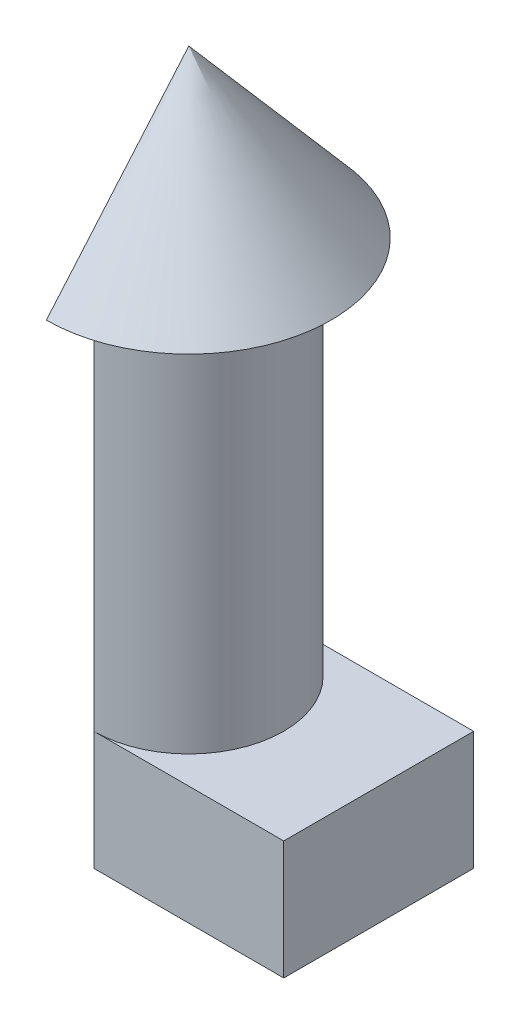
from build123d import *

# Parameters (mm, degrees)
CUT_EXTRUDE1_DEPTH      = 10
CUT_EXTRUDE1_DEPTH_BACK = 10
SKETCH3_W               = 7.711624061
SKETCH3_H               = 25.816797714
SKETCH5_W               = 8
SKETCH5_H               = 8
BOSS_EXTRUDE1_DEPTH     = 5


with BuildPart() as part:
    # Sketch2 → Revolve2 (revolve)
    with BuildSketch(Plane.XY, mode=Mode.PRIVATE) as revolve2_sk:
        Polygon((0, 0), (4, 0), (4, 16), (6, 16), (0, 23), align=None)
    revolve(revolve2_sk.sketch.rotate(Axis((0, 23, 0), (0, -1, 0)), 180), axis=Axis((0, 23, 0), (0, -1, 0)))

    # Sketch3 → Cut-Extrude1 (cut, two sides: drawn at the far end of the back side and taken through both)
    with BuildSketch(Plane.XY.offset(-CUT_EXTRUDE1_DEPTH_BACK)):
        with Locations((-3.855812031, 12.908398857)):
            Rectangle(SKETCH3_W, SKETCH3_H)
    extrude(amount=CUT_EXTRUDE1_DEPTH + CUT_EXTRUDE1_DEPTH_BACK, mode=Mode.SUBTRACT)

    # Sketch5 → Boss-Extrude1 (add)
    with BuildSketch(Plane.XZ):
        with Locations((4, 0)):
            Rectangle(SKETCH5_W, SKETCH5_H)
    extrude(amount=BOSS_EXTRUDE1_DEPTH)


solid = part.part
